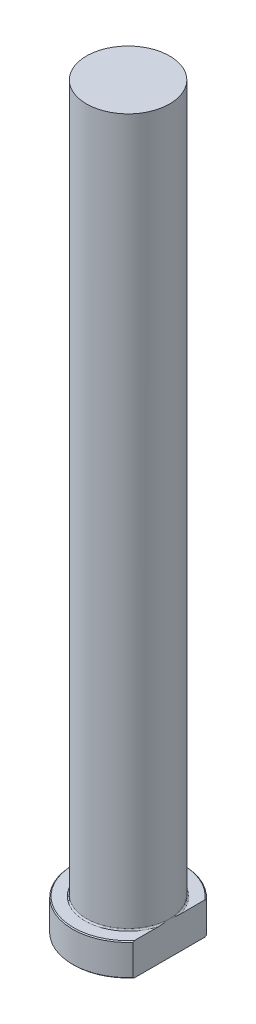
from build123d import *
from build123d.topology import SkipClean

# Parameters (mm, degrees)
CHAMFER1_SIZE = 0.2
FILLET1_R     = 0.3
KEY_DEPTH     = 161.897482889


with BuildPart() as part:
    # Sketch1 → Revolve1 (revolve)
    with BuildSketch(Plane.XY, mode=Mode.PRIVATE) as revolve1_sk:
        Polygon((0, 0), (-12, 0), (-12, 7), (-9, 7), (-9, 160), (0, 160), align=None)
    revolve(revolve1_sk.sketch.rotate(Axis((0, 259.958771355, 0), (0, -1, 0)), 270), axis=Axis((0, 259.958771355, 0), (0, -1, 0)))

    # Chamfer1
    chamfer1_edges = [part.edges().sort_by_distance(p)[0] for p in [
        (0, 7, -12),
        (0, 0, -12),
    ]]
    chamfer(chamfer1_edges, length=CHAMFER1_SIZE)

    # Fillet1
    fillet1_edges = [part.edges().sort_by_distance(p)[0] for p in [
        (0, 7, -9),
    ]]
    fillet(fillet1_edges, radius=FILLET1_R)

    # Sketch2 → KEY (cut, through all)
    with SkipClean():  # the faces are left unmerged after this step: merging them gives an invalid solid
        with BuildSketch(Plane(origin=(0, 0, 0), x_dir=(1, 0, 0), z_dir=(0, 1, 0))):
            with BuildLine():
                Line((9, 7.937253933), (9, -7.937253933))
                ThreePointArc((9, -7.937253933), (12, 0), (9, 7.937253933))
            make_face()
        extrude(amount=KEY_DEPTH, mode=Mode.SUBTRACT)


solid = part.part
